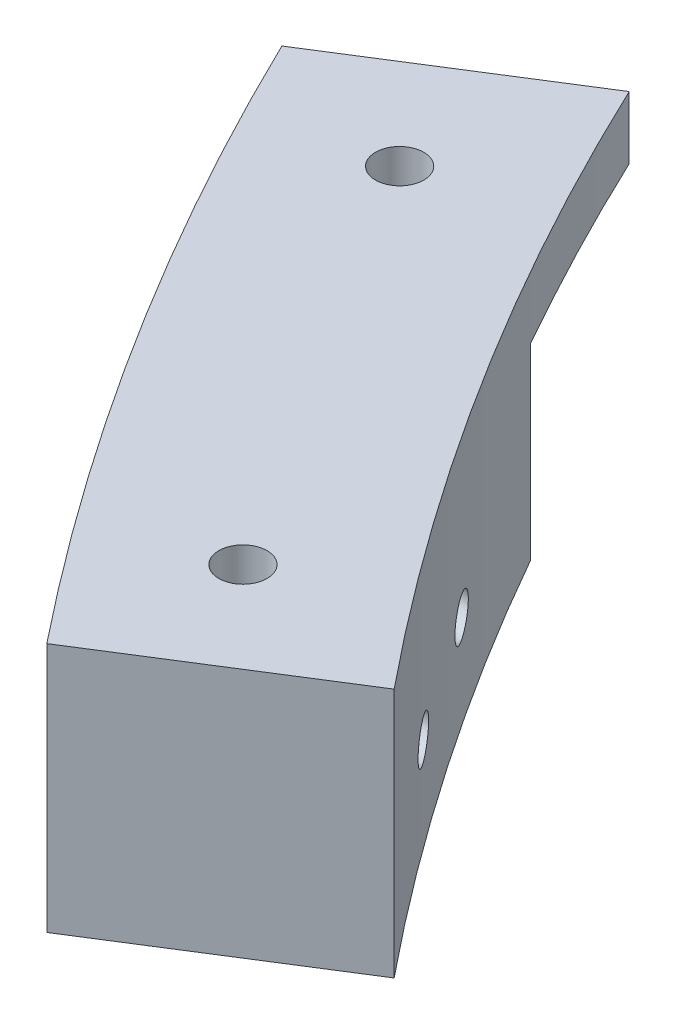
ISO-10303-21;
HEADER;
FILE_DESCRIPTION(('STEP AP214'),'2;1');
FILE_NAME('part.step','',(''),(''),'','','');
FILE_SCHEMA(('AUTOMOTIVE_DESIGN { 1 0 10303 214 1 1 1 1 }'));
ENDSEC;
DATA;
#1=APPLICATION_CONTEXT('core data for automotive mechanical design processes');
#2=APPLICATION_PROTOCOL_DEFINITION('international standard','automotive_design',2000,#1);
#3=PRODUCT_CONTEXT('',#1,'mechanical');
#4=PRODUCT('Part','Part','',(#3));
#5=PRODUCT_RELATED_PRODUCT_CATEGORY('part','',(#4));
#6=PRODUCT_DEFINITION_FORMATION('','',#4);
#7=PRODUCT_DEFINITION_CONTEXT('part definition',#1,'design');
#8=PRODUCT_DEFINITION('design','',#6,#7);
#9=PRODUCT_DEFINITION_SHAPE('','',#8);
#10=(LENGTH_UNIT() NAMED_UNIT(*) SI_UNIT(.MILLI.,.METRE.));
#11=(NAMED_UNIT(*) PLANE_ANGLE_UNIT() SI_UNIT($,.RADIAN.));
#12=(NAMED_UNIT(*) SI_UNIT($,.STERADIAN.) SOLID_ANGLE_UNIT());
#13=UNCERTAINTY_MEASURE_WITH_UNIT(LENGTH_MEASURE(1.E-05),#10,'distance_accuracy_value','');
#14=(GEOMETRIC_REPRESENTATION_CONTEXT(3) GLOBAL_UNCERTAINTY_ASSIGNED_CONTEXT((#13)) GLOBAL_UNIT_ASSIGNED_CONTEXT((#10,
#11,#12)) REPRESENTATION_CONTEXT('',''));
#15=CARTESIAN_POINT('',(0.,0.,0.));
#16=DIRECTION('',(0.,0.,1.));
#17=DIRECTION('',(1.,0.,0.));
#18=AXIS2_PLACEMENT_3D('',#15,#16,#17);
#19=CARTESIAN_POINT('',(0.,-30.1625,0.));
#20=DIRECTION('',(0.,-1.,0.));
#21=DIRECTION('',(0.,0.,-1.));
#22=AXIS2_PLACEMENT_3D('',#19,#20,#21);
#23=CYLINDRICAL_SURFACE('',#22,685.8);
#24=DIRECTION('',(0.,-1.,0.));
#25=VECTOR('',#24,1.);
#26=CARTESIAN_POINT('',(-552.45,-42.8625,406.350387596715));
#27=LINE('',#26,#25);
#28=CARTESIAN_POINT('',(-552.45,-42.8625,406.350387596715));
#29=VERTEX_POINT('',#28);
#30=CARTESIAN_POINT('',(-552.45,-80.9625,406.350387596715));
#31=VERTEX_POINT('',#30);
#32=EDGE_CURVE('E101',#29,#31,#27,.T.);
#33=ORIENTED_EDGE('',*,*,#32,.T.);
#34=CARTESIAN_POINT('',(0.,-80.9625,0.));
#35=DIRECTION('',(0.,-1.,0.));
#36=DIRECTION('',(0.,0.,-1.));
#37=AXIS2_PLACEMENT_3D('',#34,#35,#36);
#38=CIRCLE('',#37,685.8);
#39=CARTESIAN_POINT('',(-536.089202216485,-80.9625,427.703176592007));
#40=VERTEX_POINT('',#39);
#41=EDGE_CURVE('E119',#40,#31,#38,.T.);
#42=ORIENTED_EDGE('',*,*,#41,.F.);
#43=DIRECTION('',(0.,-1.,0.));
#44=VECTOR('',#43,1.);
#45=CARTESIAN_POINT('',(-536.089202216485,-30.1625,427.703176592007));
#46=LINE('',#45,#44);
#47=CARTESIAN_POINT('',(-536.089202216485,-30.1625,427.703176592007));
#48=VERTEX_POINT('',#47);
#49=EDGE_CURVE('E11',#48,#40,#46,.T.);
#50=ORIENTED_EDGE('',*,*,#49,.F.);
#51=CARTESIAN_POINT('',(0.,-30.1625,0.));
#52=DIRECTION('',(0.,-1.,0.));
#53=DIRECTION('',(0.,0.,-1.));
#54=AXIS2_PLACEMENT_3D('',#51,#52,#53);
#55=CIRCLE('',#54,685.8);
#56=CARTESIAN_POINT('',(-617.309061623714,-30.1625,298.74933043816));
#57=VERTEX_POINT('',#56);
#58=EDGE_CURVE('E124',#48,#57,#55,.T.);
#59=ORIENTED_EDGE('',*,*,#58,.T.);
#60=DIRECTION('',(0.,-1.,0.));
#61=VECTOR('',#60,1.);
#62=CARTESIAN_POINT('',(-617.309061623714,-30.1625,298.74933043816));
#63=LINE('',#62,#61);
#64=CARTESIAN_POINT('',(-617.309061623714,-42.8625,298.74933043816));
#65=VERTEX_POINT('',#64);
#66=EDGE_CURVE('E81',#57,#65,#63,.T.);
#67=ORIENTED_EDGE('',*,*,#66,.T.);
#68=CARTESIAN_POINT('',(0.,-42.8625,0.));
#69=DIRECTION('',(0.,-1.,0.));
#70=DIRECTION('',(0.,0.,-1.));
#71=AXIS2_PLACEMENT_3D('',#68,#69,#70);
#72=CIRCLE('',#71,685.8);
#73=EDGE_CURVE('E104',#29,#65,#72,.T.);
#74=ORIENTED_EDGE('',*,*,#73,.F.);
#75=EDGE_LOOP('',(#33,#42,#50,#59,#67,#74));
#76=FACE_BOUND('',#75,.T.);
#77=ADVANCED_FACE('F33',(#76),#23,.T.);
#78=CARTESIAN_POINT('',(-492.8151190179,-30.1625,400.447572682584));
#79=DIRECTION('',(0.532938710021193,0.,0.846153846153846));
#80=DIRECTION('',(0.846153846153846,0.,-0.532938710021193));
#81=AXIS2_PLACEMENT_3D('',#78,#79,#80);
#82=PLANE('',#81);
#83=DIRECTION('',(-0.846153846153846,0.,0.532938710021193));
#84=VECTOR('',#83,1.);
#85=CARTESIAN_POINT('',(-492.8151190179,-80.9625,400.447572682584));
#86=LINE('',#85,#84);
#87=CARTESIAN_POINT('',(-492.8151190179,-80.9625,400.447572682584));
#88=VERTEX_POINT('',#87);
#89=EDGE_CURVE('E127',#88,#40,#86,.T.);
#90=ORIENTED_EDGE('',*,*,#89,.F.);
#91=DIRECTION('',(0.,-1.,0.));
#92=VECTOR('',#91,1.);
#93=CARTESIAN_POINT('',(-492.8151190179,-30.1625,400.447572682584));
#94=LINE('',#93,#92);
#95=CARTESIAN_POINT('',(-492.8151190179,-30.1625,400.447572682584));
#96=VERTEX_POINT('',#95);
#97=EDGE_CURVE('E45',#96,#88,#94,.T.);
#98=ORIENTED_EDGE('',*,*,#97,.F.);
#99=DIRECTION('',(-0.846153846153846,0.,0.532938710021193));
#100=VECTOR('',#99,1.);
#101=CARTESIAN_POINT('',(-492.8151190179,-30.1625,400.447572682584));
#102=LINE('',#101,#100);
#103=EDGE_CURVE('E132',#96,#48,#102,.T.);
#104=ORIENTED_EDGE('',*,*,#103,.T.);
#105=ORIENTED_EDGE('',*,*,#49,.T.);
#106=EDGE_LOOP('',(#90,#98,#104,#105));
#107=FACE_BOUND('',#106,.T.);
#108=ADVANCED_FACE('F180',(#107),#82,.T.);
#109=CARTESIAN_POINT('',(0.,-30.1625,0.));
#110=DIRECTION('',(0.,-1.,0.));
#111=DIRECTION('',(0.,0.,-1.));
#112=AXIS2_PLACEMENT_3D('',#109,#110,#111);
#113=CYLINDRICAL_SURFACE('',#112,635.);
#114=CARTESIAN_POINT('',(-527.694527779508,-61.9125,353.21875));
#115=CARTESIAN_POINT('',(-527.694528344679,-62.0103204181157,353.218749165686));
#116=CARTESIAN_POINT('',(-527.69695293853,-62.1081730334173,353.215126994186));
#117=CARTESIAN_POINT('',(-527.70661718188,-62.3031490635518,353.200688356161));
#118=CARTESIAN_POINT('',(-527.713859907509,-62.4002719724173,353.189867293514));
#119=CARTESIAN_POINT('',(-527.733074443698,-62.5932023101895,353.161156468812));
#120=CARTESIAN_POINT('',(-527.745055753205,-62.6890066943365,353.143252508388));
#121=CARTESIAN_POINT('',(-527.77356722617,-62.8784128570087,353.100640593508));
#122=CARTESIAN_POINT('',(-527.790099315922,-62.9720136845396,353.075929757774));
#123=CARTESIAN_POINT('',(-527.846016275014,-63.2476228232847,352.992333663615));
#124=CARTESIAN_POINT('',(-527.891834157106,-63.4255328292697,352.923817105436));
#125=CARTESIAN_POINT('',(-527.998352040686,-63.7659017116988,352.764438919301));
#126=CARTESIAN_POINT('',(-528.059047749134,-63.9283650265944,352.673583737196));
#127=CARTESIAN_POINT('',(-528.19715996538,-64.245270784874,352.466702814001));
#128=CARTESIAN_POINT('',(-528.275393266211,-64.3985495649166,352.349445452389));
#129=CARTESIAN_POINT('',(-528.443141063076,-64.6832583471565,352.097812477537));
#130=CARTESIAN_POINT('',(-528.532661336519,-64.8146770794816,351.963428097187));
#131=CARTESIAN_POINT('',(-528.735599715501,-65.074198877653,351.658505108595));
#132=CARTESIAN_POINT('',(-528.850544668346,-65.1983593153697,351.485629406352));
#133=CARTESIAN_POINT('',(-529.088867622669,-65.4157483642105,351.126781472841));
#134=CARTESIAN_POINT('',(-529.212250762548,-65.5089579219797,350.940801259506));
#135=CARTESIAN_POINT('',(-529.48540995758,-65.677287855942,350.528559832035));
#136=CARTESIAN_POINT('',(-529.636187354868,-65.7469050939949,350.30070729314));
#137=CARTESIAN_POINT('',(-529.941492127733,-65.8444559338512,349.838665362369));
#138=CARTESIAN_POINT('',(-530.096021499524,-65.8723668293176,349.604472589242));
#139=CARTESIAN_POINT('',(-530.422755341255,-65.8873165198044,349.108576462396));
#140=CARTESIAN_POINT('',(-530.594998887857,-65.8694216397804,348.84673275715));
#141=CARTESIAN_POINT('',(-530.935196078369,-65.7817871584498,348.328743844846));
#142=CARTESIAN_POINT('',(-531.103146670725,-65.7120116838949,348.072602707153));
#143=CARTESIAN_POINT('',(-531.430717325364,-65.5192121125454,347.5722692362));
#144=CARTESIAN_POINT('',(-531.590277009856,-65.3958491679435,347.328164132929));
#145=CARTESIAN_POINT('',(-531.817345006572,-65.1711081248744,346.980303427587));
#146=CARTESIAN_POINT('',(-531.890973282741,-65.0896020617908,346.867423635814));
#147=CARTESIAN_POINT('',(-532.033295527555,-64.9134832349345,346.649086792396));
#148=CARTESIAN_POINT('',(-532.101991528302,-64.8188759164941,346.543626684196));
#149=CARTESIAN_POINT('',(-532.261684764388,-64.5733547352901,346.298322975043));
#150=CARTESIAN_POINT('',(-532.349641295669,-64.4156733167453,346.16308433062));
#151=CARTESIAN_POINT('',(-532.46994233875,-64.1610443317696,345.977984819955));
#152=CARTESIAN_POINT('',(-532.508113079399,-64.0731221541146,345.919230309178));
#153=CARTESIAN_POINT('',(-532.580173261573,-63.8915914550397,345.808275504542));
#154=CARTESIAN_POINT('',(-532.614064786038,-63.7979857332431,345.756072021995));
#155=CARTESIAN_POINT('',(-532.677376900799,-63.6048578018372,345.658524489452));
#156=CARTESIAN_POINT('',(-532.706762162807,-63.5052965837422,345.613234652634));
#157=CARTESIAN_POINT('',(-532.76032190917,-63.3016026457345,345.530666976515));
#158=CARTESIAN_POINT('',(-532.784498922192,-63.197472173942,345.493385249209));
#159=CARTESIAN_POINT('',(-532.827268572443,-62.9854365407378,345.427421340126));
#160=CARTESIAN_POINT('',(-532.845862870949,-62.8775325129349,345.398736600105));
#161=CARTESIAN_POINT('',(-532.877154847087,-62.6588757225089,345.350457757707));
#162=CARTESIAN_POINT('',(-532.889853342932,-62.548123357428,345.330862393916));
#163=CARTESIAN_POINT('',(-532.907970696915,-62.3382175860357,345.302903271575));
#164=CARTESIAN_POINT('',(-532.914079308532,-62.2392638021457,345.293475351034));
#165=CARTESIAN_POINT('',(-532.921465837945,-62.0407126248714,345.282074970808));
#166=CARTESIAN_POINT('',(-532.922742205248,-61.9411150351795,345.280104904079));
#167=CARTESIAN_POINT('',(-532.920438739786,-61.7421758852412,345.28366017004));
#168=CARTESIAN_POINT('',(-532.916862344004,-61.6428341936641,345.28918019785));
#169=CARTESIAN_POINT('',(-532.904918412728,-61.4451185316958,345.30761364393));
#170=CARTESIAN_POINT('',(-532.896549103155,-61.3467449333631,345.320529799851));
#171=CARTESIAN_POINT('',(-532.865601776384,-61.0651395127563,345.368284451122));
#172=CARTESIAN_POINT('',(-532.837005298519,-60.8840286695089,345.41240610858));
#173=CARTESIAN_POINT('',(-532.764475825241,-60.5326603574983,345.524264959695));
#174=CARTESIAN_POINT('',(-532.720540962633,-60.3624042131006,345.592005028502));
#175=CARTESIAN_POINT('',(-532.616513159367,-60.0274598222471,345.752309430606));
#176=CARTESIAN_POINT('',(-532.555692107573,-59.8635350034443,345.845991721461));
#177=CARTESIAN_POINT('',(-532.421466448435,-59.5540593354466,346.052593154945));
#178=CARTESIAN_POINT('',(-532.348056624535,-59.4085161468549,346.165520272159));
#179=CARTESIAN_POINT('',(-532.180828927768,-59.1199112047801,346.422562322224));
#180=CARTESIAN_POINT('',(-532.085600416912,-58.9795811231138,346.568820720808));
#181=CARTESIAN_POINT('',(-531.885035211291,-58.7253975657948,346.87655313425));
#182=CARTESIAN_POINT('',(-531.779692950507,-58.611558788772,347.038035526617));
#183=CARTESIAN_POINT('',(-531.543787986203,-58.3943914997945,347.399273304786));
#184=CARTESIAN_POINT('',(-531.411904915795,-58.29575718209,347.600989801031));
#185=CARTESIAN_POINT('',(-531.141460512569,-58.1345712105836,348.014094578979));
#186=CARTESIAN_POINT('',(-531.002895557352,-58.0720393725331,348.225488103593));
#187=CARTESIAN_POINT('',(-530.701717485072,-57.976311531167,348.684345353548));
#188=CARTESIAN_POINT('',(-530.538526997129,-57.9486730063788,348.932600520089));
#189=CARTESIAN_POINT('',(-530.211334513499,-57.9400236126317,349.429577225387));
#190=CARTESIAN_POINT('',(-530.047331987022,-57.959048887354,349.678298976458));
#191=CARTESIAN_POINT('',(-529.711142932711,-58.0467999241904,350.18738474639));
#192=CARTESIAN_POINT('',(-529.539196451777,-58.1189409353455,350.447330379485));
#193=CARTESIAN_POINT('',(-529.20465337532,-58.31715036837,350.952313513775));
#194=CARTESIAN_POINT('',(-529.042049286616,-58.4431748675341,351.197362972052));
#195=CARTESIAN_POINT('',(-528.765889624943,-58.716359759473,351.612972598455));
#196=CARTESIAN_POINT('',(-528.649275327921,-58.8532584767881,351.788264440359));
#197=CARTESIAN_POINT('',(-528.429914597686,-59.1597183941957,352.11768540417));
#198=CARTESIAN_POINT('',(-528.32715074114,-59.3292378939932,352.271841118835));
#199=CARTESIAN_POINT('',(-528.154350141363,-59.6707040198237,352.530853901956));
#200=CARTESIAN_POINT('',(-528.08171256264,-59.8383438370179,352.639643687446));
#201=CARTESIAN_POINT('',(-527.952781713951,-60.1930920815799,352.832642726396));
#202=CARTESIAN_POINT('',(-527.896484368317,-60.3801956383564,352.916858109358));
#203=CARTESIAN_POINT('',(-527.80799007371,-60.7499082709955,353.049191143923));
#204=CARTESIAN_POINT('',(-527.773931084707,-60.931056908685,353.100098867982));
#205=CARTESIAN_POINT('',(-527.735924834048,-61.2081925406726,353.156897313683));
#206=CARTESIAN_POINT('',(-527.725439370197,-61.3014026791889,353.172565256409));
#207=CARTESIAN_POINT('',(-527.708932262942,-61.4890760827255,353.19722966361));
#208=CARTESIAN_POINT('',(-527.702908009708,-61.5835385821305,353.206230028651));
#209=CARTESIAN_POINT('',(-527.697615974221,-61.7172367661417,353.214136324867));
#210=CARTESIAN_POINT('',(-527.696458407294,-61.7562571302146,353.215865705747));
#211=CARTESIAN_POINT('',(-527.694914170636,-61.8343499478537,353.218172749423));
#212=CARTESIAN_POINT('',(-527.694527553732,-61.8734224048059,353.218750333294));
#213=CARTESIAN_POINT('',(-527.694527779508,-61.9125,353.21875));
#214=B_SPLINE_CURVE_WITH_KNOTS('',3,(#114,#115,#116,#117,#118,#119,#120,#121,#122,#123,#124,
#125,#126,#127,#128,#129,#130,#131,#132,#133,#134,#135,#136,#137,#138,#139,#140,#141,#142,#143,
#144,#145,#146,#147,#148,#149,#150,#151,#152,#153,#154,#155,#156,#157,#158,#159,#160,#161,#162,
#163,#164,#165,#166,#167,#168,#169,#170,#171,#172,#173,#174,#175,#176,#177,#178,#179,#180,#181,
#182,#183,#184,#185,#186,#187,#188,#189,#190,#191,#192,#193,#194,#195,#196,#197,#198,#199,#200,
#201,#202,#203,#204,#205,#206,#207,#208,#209,#210,#211,#212,#213),.UNSPECIFIED.,.T.,.F.,(4,2,2,
2,2,2,2,2,2,2,2,2,2,2,2,2,2,2,2,2,2,2,2,2,2,2,2,2,2,2,2,2,2,2,2,2,2,2,2,2,2,2,2,2,2,2,2,2,2,4),
(0.,0.293419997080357,0.587027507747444,0.881226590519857,1.17555039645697,1.76090071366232,
2.34608232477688,2.96840755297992,3.59105263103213,4.31397495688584,5.03734149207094,
5.87977886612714,6.72267472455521,7.66008018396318,8.59813442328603,9.54220859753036,
10.0140248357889,10.4856455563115,11.1591409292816,11.4960835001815,11.832861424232,
12.1721577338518,12.511288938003,12.8503191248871,13.1893022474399,13.4876830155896,
13.7861595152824,14.0844247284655,14.382800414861,14.9458117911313,15.508891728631,
16.1015776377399,16.694509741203,17.363775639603,18.033411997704,18.811585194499,
19.5901851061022,20.4815023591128,21.3735102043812,22.3285170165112,23.2827468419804,
24.0331889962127,24.7826781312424,25.4179493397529,26.0530619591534,26.623918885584,
26.9089285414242,27.1937713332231,27.3109796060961,27.4281959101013),.UNSPECIFIED.);
#215=CARTESIAN_POINT('',(-527.694527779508,-61.9125,353.21875));
#216=VERTEX_POINT('',#215);
#217=EDGE_CURVE('E36',#216,#216,#214,.T.);
#218=ORIENTED_EDGE('',*,*,#217,.F.);
#219=EDGE_LOOP('',(#218));
#220=FACE_BOUND('',#219,.T.);
#221=CARTESIAN_POINT('',(-509.777247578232,-61.9125,378.61875));
#222=CARTESIAN_POINT('',(-509.77724817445,-62.0081277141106,378.618749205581));
#223=CARTESIAN_POINT('',(-509.779819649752,-62.1037907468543,378.615287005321));
#224=CARTESIAN_POINT('',(-509.790065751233,-62.2943876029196,378.601490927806));
#225=CARTESIAN_POINT('',(-509.797743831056,-62.3893208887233,378.591152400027));
#226=CARTESIAN_POINT('',(-509.818102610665,-62.5778820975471,378.563736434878));
#227=CARTESIAN_POINT('',(-509.830793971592,-62.671506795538,378.546644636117));
#228=CARTESIAN_POINT('',(-509.860972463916,-62.8565673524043,378.50599650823));
#229=CARTESIAN_POINT('',(-509.878461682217,-62.9480022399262,378.482437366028));
#230=CARTESIAN_POINT('',(-509.937535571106,-63.2170599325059,378.402846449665));
#231=CARTESIAN_POINT('',(-509.985860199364,-63.3906337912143,378.337721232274));
#232=CARTESIAN_POINT('',(-510.097947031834,-63.7227248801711,378.186585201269));
#233=CARTESIAN_POINT('',(-510.161704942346,-63.8812462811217,378.100580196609));
#234=CARTESIAN_POINT('',(-510.307038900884,-64.1919522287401,377.904408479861));
#235=CARTESIAN_POINT('',(-510.389562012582,-64.3428765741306,377.792955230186));
#236=CARTESIAN_POINT('',(-510.566254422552,-64.6237819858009,377.554131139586));
#237=CARTESIAN_POINT('',(-510.66042994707,-64.7537517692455,377.426751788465));
#238=CARTESIAN_POINT('',(-510.876391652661,-65.0147642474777,377.134394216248));
#239=CARTESIAN_POINT('',(-511.000036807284,-65.1413949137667,376.966853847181));
#240=CARTESIAN_POINT('',(-511.256369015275,-65.364489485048,376.619133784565));
#241=CARTESIAN_POINT('',(-511.389062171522,-65.4609327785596,376.438945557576));
#242=CARTESIAN_POINT('',(-511.687041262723,-65.6399796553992,376.033837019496));
#243=CARTESIAN_POINT('',(-511.853633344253,-65.716207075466,375.807050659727));
#244=CARTESIAN_POINT('',(-512.191308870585,-65.8267924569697,375.346699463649));
#245=CARTESIAN_POINT('',(-512.362394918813,-65.8611255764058,375.113130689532));
#246=CARTESIAN_POINT('',(-512.729313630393,-65.8900769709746,374.611479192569));
#247=CARTESIAN_POINT('',(-512.925275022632,-65.8784996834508,374.343119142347));
#248=CARTESIAN_POINT('',(-513.313343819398,-65.8008252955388,373.810806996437));
#249=CARTESIAN_POINT('',(-513.505447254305,-65.7346747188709,373.546859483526));
#250=CARTESIAN_POINT('',(-513.787593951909,-65.5930084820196,373.158592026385));
#251=CARTESIAN_POINT('',(-513.881463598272,-65.5380152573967,373.029309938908));
#252=CARTESIAN_POINT('',(-514.065759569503,-65.4134220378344,372.775293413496));
#253=CARTESIAN_POINT('',(-514.156185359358,-65.3438197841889,372.65055968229));
#254=CARTESIAN_POINT('',(-514.332360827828,-65.1900324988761,372.40736448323));
#255=CARTESIAN_POINT('',(-514.41811961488,-65.105877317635,372.288890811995));
#256=CARTESIAN_POINT('',(-514.583949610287,-64.9229038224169,372.05964417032));
#257=CARTESIAN_POINT('',(-514.664023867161,-64.8240934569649,371.948867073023));
#258=CARTESIAN_POINT('',(-514.842953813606,-64.5762457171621,371.701174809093));
#259=CARTESIAN_POINT('',(-514.939104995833,-64.4214758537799,371.567949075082));
#260=CARTESIAN_POINT('',(-515.11533363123,-64.087076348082,371.323599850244));
#261=CARTESIAN_POINT('',(-515.195420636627,-63.9074615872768,371.212463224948));
#262=CARTESIAN_POINT('',(-515.300722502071,-63.6211419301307,371.066259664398));
#263=CARTESIAN_POINT('',(-515.333471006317,-63.5223771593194,371.020776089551));
#264=CARTESIAN_POINT('',(-515.393340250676,-63.319997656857,370.937605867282));
#265=CARTESIAN_POINT('',(-515.420463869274,-63.2163854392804,370.899915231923));
#266=CARTESIAN_POINT('',(-515.468600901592,-63.0051379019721,370.833012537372));
#267=CARTESIAN_POINT('',(-515.489617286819,-62.8975045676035,370.803796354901));
#268=CARTESIAN_POINT('',(-515.525151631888,-62.6791386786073,370.754391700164));
#269=CARTESIAN_POINT('',(-515.539670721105,-62.5684066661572,370.734201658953));
#270=CARTESIAN_POINT('',(-515.560388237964,-62.360281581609,370.705390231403));
#271=CARTESIAN_POINT('',(-515.567454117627,-62.2631395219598,370.695562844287));
#272=CARTESIAN_POINT('',(-515.57641394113,-62.0681622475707,370.683101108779));
#273=CARTESIAN_POINT('',(-515.578308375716,-61.9703270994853,370.680466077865));
#274=CARTESIAN_POINT('',(-515.576892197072,-61.7747967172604,370.682435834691));
#275=CARTESIAN_POINT('',(-515.573583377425,-61.6771014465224,370.687038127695));
#276=CARTESIAN_POINT('',(-515.56182734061,-61.4826496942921,370.703388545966));
#277=CARTESIAN_POINT('',(-515.553380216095,-61.3858931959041,370.715136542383));
#278=CARTESIAN_POINT('',(-515.522031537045,-61.111539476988,370.758730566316));
#279=CARTESIAN_POINT('',(-515.492946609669,-60.935909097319,370.799172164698));
#280=CARTESIAN_POINT('',(-515.418895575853,-60.5949231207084,370.902097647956));
#281=CARTESIAN_POINT('',(-515.373927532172,-60.4295687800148,370.964584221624));
#282=CARTESIAN_POINT('',(-515.267060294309,-60.1028869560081,371.113008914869));
#283=CARTESIAN_POINT('',(-515.204323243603,-59.9423634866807,371.200106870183));
#284=CARTESIAN_POINT('',(-515.065841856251,-59.6386719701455,371.392235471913));
#285=CARTESIAN_POINT('',(-514.990091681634,-59.4955117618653,371.497274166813));
#286=CARTESIAN_POINT('',(-514.816014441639,-59.2080161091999,371.738478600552));
#287=CARTESIAN_POINT('',(-514.716005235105,-59.0666407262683,371.876950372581));
#288=CARTESIAN_POINT('',(-514.50529488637,-58.8091753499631,372.168421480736));
#289=CARTESIAN_POINT('',(-514.394587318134,-58.6931006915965,372.32142954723));
#290=CARTESIAN_POINT('',(-514.143419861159,-58.4666149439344,372.668214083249));
#291=CARTESIAN_POINT('',(-514.001299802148,-58.3614549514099,372.86421828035));
#292=CARTESIAN_POINT('',(-513.709546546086,-58.1863977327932,373.266076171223));
#293=CARTESIAN_POINT('',(-513.55990895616,-58.116521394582,373.471935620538));
#294=CARTESIAN_POINT('',(-513.22948129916,-58.0021716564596,373.925916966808));
#295=CARTESIAN_POINT('',(-513.047841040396,-57.9643277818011,374.17510390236));
#296=CARTESIAN_POINT('',(-512.682806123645,-57.9359263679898,374.675107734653));
#297=CARTESIAN_POINT('',(-512.499409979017,-57.9454132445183,374.925925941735));
#298=CARTESIAN_POINT('',(-512.117681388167,-58.0149249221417,375.447192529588));
#299=CARTESIAN_POINT('',(-511.919606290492,-58.0797164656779,375.717212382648));
#300=CARTESIAN_POINT('',(-511.532810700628,-58.2670700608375,376.243657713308));
#301=CARTESIAN_POINT('',(-511.344082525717,-58.3895837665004,376.500094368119));
#302=CARTESIAN_POINT('',(-511.026130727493,-58.6576218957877,376.931489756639));
#303=CARTESIAN_POINT('',(-510.893353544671,-58.7909523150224,377.111424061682));
#304=CARTESIAN_POINT('',(-510.642267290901,-59.0920658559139,377.451346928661));
#305=CARTESIAN_POINT('',(-510.52393609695,-59.2597952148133,377.61136599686));
#306=CARTESIAN_POINT('',(-510.326466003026,-59.5957789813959,377.878182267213));
#307=CARTESIAN_POINT('',(-510.244101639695,-59.7585941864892,377.989380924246));
#308=CARTESIAN_POINT('',(-510.133284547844,-60.0181686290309,378.13891080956));
#309=CARTESIAN_POINT('',(-510.098446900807,-60.107320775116,378.185903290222));
#310=CARTESIAN_POINT('',(-510.033484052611,-60.290331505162,378.273509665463));
#311=CARTESIAN_POINT('',(-510.003356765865,-60.3841879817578,378.314126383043));
#312=CARTESIAN_POINT('',(-509.948010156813,-60.5769577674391,378.388727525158));
#313=CARTESIAN_POINT('',(-509.922837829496,-60.6759092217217,378.422648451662));
#314=CARTESIAN_POINT('',(-509.878186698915,-60.8773216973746,378.482808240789));
#315=CARTESIAN_POINT('',(-509.858704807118,-60.9797807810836,378.509051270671));
#316=CARTESIAN_POINT('',(-509.825828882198,-61.1871129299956,378.55333173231));
#317=CARTESIAN_POINT('',(-509.812418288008,-61.2919785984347,378.571391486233));
#318=CARTESIAN_POINT('',(-509.79188478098,-61.5033685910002,378.59904187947));
#319=CARTESIAN_POINT('',(-509.784756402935,-61.609891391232,378.60863988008));
#320=CARTESIAN_POINT('',(-509.779641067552,-61.7492903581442,378.615527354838));
#321=CARTESIAN_POINT('',(-509.778743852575,-61.7819128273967,378.61673538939));
#322=CARTESIAN_POINT('',(-509.777547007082,-61.8471888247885,378.618346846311));
#323=CARTESIAN_POINT('',(-509.777247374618,-61.8798423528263,378.6187502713));
#324=CARTESIAN_POINT('',(-509.777247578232,-61.9125,378.61875));
#325=B_SPLINE_CURVE_WITH_KNOTS('',3,(#221,#222,#223,#224,#225,#226,#227,#228,#229,#230,#231,
#232,#233,#234,#235,#236,#237,#238,#239,#240,#241,#242,#243,#244,#245,#246,#247,#248,#249,#250,
#251,#252,#253,#254,#255,#256,#257,#258,#259,#260,#261,#262,#263,#264,#265,#266,#267,#268,#269,
#270,#271,#272,#273,#274,#275,#276,#277,#278,#279,#280,#281,#282,#283,#284,#285,#286,#287,#288,
#289,#290,#291,#292,#293,#294,#295,#296,#297,#298,#299,#300,#301,#302,#303,#304,#305,#306,#307,
#308,#309,#310,#311,#312,#313,#314,#315,#316,#317,#318,#319,#320,#321,#322,#323,#324),
.UNSPECIFIED.,.T.,.F.,(4,2,2,2,2,2,2,2,2,2,2,2,2,2,2,2,2,2,2,2,2,2,2,2,2,2,2,2,2,2,2,2,2,2,2,2,
2,2,2,2,2,2,2,2,2,2,2,2,2,2,2,4),(0.,0.286847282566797,0.573888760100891,0.861543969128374,
1.14932449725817,1.72127675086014,2.29307006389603,2.90568180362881,3.51862230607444,
4.24705288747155,4.97597975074,5.84719128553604,6.71891917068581,7.71202688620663,
8.70610890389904,9.21241061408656,9.71879066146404,10.2241441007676,10.7292244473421,
11.4036508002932,12.0776749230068,12.4179260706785,12.758002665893,13.0979135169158,
13.4377652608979,13.7310549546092,14.0243168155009,14.3174776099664,14.6106331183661,
15.1556580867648,15.7007495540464,16.277788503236,16.8550870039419,17.5178006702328,
18.1809149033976,18.9698171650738,19.7591859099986,20.6873906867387,21.6164666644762,
22.6347822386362,23.6522464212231,24.4303457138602,25.2072380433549,25.8454390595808,
26.1649934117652,26.4844058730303,26.8067154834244,27.1288498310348,27.4501000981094,
27.7710706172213,27.8690316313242,27.9669923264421),.UNSPECIFIED.);
#326=CARTESIAN_POINT('',(-509.777247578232,-61.9125,378.61875));
#327=VERTEX_POINT('',#326);
#328=EDGE_CURVE('E142',#327,#327,#325,.T.);
#329=ORIENTED_EDGE('',*,*,#328,.F.);
#330=EDGE_LOOP('',(#329));
#331=FACE_BOUND('',#330,.T.);
#332=DIRECTION('',(0.,-1.,0.));
#333=VECTOR('',#332,1.);
#334=CARTESIAN_POINT('',(-552.45,-42.8625,313.087843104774));
#335=LINE('',#334,#333);
#336=CARTESIAN_POINT('',(-552.45,-42.8625,313.087843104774));
#337=VERTEX_POINT('',#336);
#338=CARTESIAN_POINT('',(-552.45,-80.9625,313.087843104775));
#339=VERTEX_POINT('',#338);
#340=EDGE_CURVE('E53',#337,#339,#335,.T.);
#341=ORIENTED_EDGE('',*,*,#340,.F.);
#342=CARTESIAN_POINT('',(0.,-42.8625,0.));
#343=DIRECTION('',(0.,1.,0.));
#344=DIRECTION('',(0.,0.,1.));
#345=AXIS2_PLACEMENT_3D('',#342,#343,#344);
#346=CIRCLE('',#345,635.);
#347=CARTESIAN_POINT('',(-574.03497842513,-42.8625,271.493726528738));
#348=VERTEX_POINT('',#347);
#349=EDGE_CURVE('E105',#348,#337,#346,.T.);
#350=ORIENTED_EDGE('',*,*,#349,.F.);
#351=DIRECTION('',(0.,-1.,0.));
#352=VECTOR('',#351,1.);
#353=CARTESIAN_POINT('',(-574.03497842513,-30.1625,271.493726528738));
#354=LINE('',#353,#352);
#355=CARTESIAN_POINT('',(-574.03497842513,-30.1625,271.493726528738));
#356=VERTEX_POINT('',#355);
#357=EDGE_CURVE('E140',#356,#348,#354,.T.);
#358=ORIENTED_EDGE('',*,*,#357,.F.);
#359=CARTESIAN_POINT('',(0.,-30.1625,0.));
#360=DIRECTION('',(0.,1.,0.));
#361=DIRECTION('',(0.,0.,1.));
#362=AXIS2_PLACEMENT_3D('',#359,#360,#361);
#363=CIRCLE('',#362,635.);
#364=EDGE_CURVE('E129',#356,#96,#363,.T.);
#365=ORIENTED_EDGE('',*,*,#364,.T.);
#366=ORIENTED_EDGE('',*,*,#97,.T.);
#367=CARTESIAN_POINT('',(0.,-80.9625,0.));
#368=DIRECTION('',(0.,1.,0.));
#369=DIRECTION('',(0.,0.,1.));
#370=AXIS2_PLACEMENT_3D('',#367,#368,#369);
#371=CIRCLE('',#370,635.);
#372=EDGE_CURVE('E117',#339,#88,#371,.T.);
#373=ORIENTED_EDGE('',*,*,#372,.F.);
#374=EDGE_LOOP('',(#341,#350,#358,#365,#366,#373));
#375=FACE_BOUND('',#374,.T.);
#376=ADVANCED_FACE('F115',(#220,#331,#375),#113,.F.);
#377=CARTESIAN_POINT('',(-617.309061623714,-30.1625,298.74933043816));
#378=DIRECTION('',(-0.532938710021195,0.,-0.846153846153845));
#379=DIRECTION('',(-0.846153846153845,0.,0.532938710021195));
#380=AXIS2_PLACEMENT_3D('',#377,#378,#379);
#381=PLANE('',#380);
#382=DIRECTION('',(0.846153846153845,0.,-0.532938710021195));
#383=VECTOR('',#382,1.);
#384=CARTESIAN_POINT('',(-617.309061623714,-42.8625,298.74933043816));
#385=LINE('',#384,#383);
#386=EDGE_CURVE('E109',#65,#348,#385,.T.);
#387=ORIENTED_EDGE('',*,*,#386,.F.);
#388=ORIENTED_EDGE('',*,*,#66,.F.);
#389=DIRECTION('',(0.846153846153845,0.,-0.532938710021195));
#390=VECTOR('',#389,1.);
#391=CARTESIAN_POINT('',(-617.309061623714,-30.1625,298.74933043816));
#392=LINE('',#391,#390);
#393=EDGE_CURVE('E126',#57,#356,#392,.T.);
#394=ORIENTED_EDGE('',*,*,#393,.T.);
#395=ORIENTED_EDGE('',*,*,#357,.T.);
#396=EDGE_LOOP('',(#387,#388,#394,#395));
#397=FACE_BOUND('',#396,.T.);
#398=ADVANCED_FACE('F176',(#397),#381,.T.);
#399=CARTESIAN_POINT('',(0.,-30.1625,0.));
#400=DIRECTION('',(0.,-1.,0.));
#401=DIRECTION('',(0.,0.,-1.));
#402=AXIS2_PLACEMENT_3D('',#399,#400,#401);
#403=PLANE('',#402);
#404=CARTESIAN_POINT('',(-584.217579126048,-30.1625,307.925283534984));
#405=DIRECTION('',(0.,1.,0.));
#406=DIRECTION('',(0.,0.,1.));
#407=AXIS2_PLACEMENT_3D('',#404,#405,#406);
#408=CIRCLE('',#407,4.90219999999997);
#409=CARTESIAN_POINT('',(-584.217579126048,-30.1625,312.827483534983));
#410=VERTEX_POINT('',#409);
#411=EDGE_CURVE('E147',#410,#410,#408,.T.);
#412=ORIENTED_EDGE('',*,*,#411,.F.);
#413=EDGE_LOOP('',(#412));
#414=FACE_BOUND('',#413,.T.);
#415=CARTESIAN_POINT('',(-530.071006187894,-30.1625,393.894514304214));
#416=DIRECTION('',(0.,-1.,0.));
#417=DIRECTION('',(0.,0.,-1.));
#418=AXIS2_PLACEMENT_3D('',#415,#416,#417);
#419=CIRCLE('',#418,4.90219999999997);
#420=CARTESIAN_POINT('',(-530.071006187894,-30.1625,388.992314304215));
#421=VERTEX_POINT('',#420);
#422=EDGE_CURVE('E192',#421,#421,#419,.T.);
#423=ORIENTED_EDGE('',*,*,#422,.T.);
#424=EDGE_LOOP('',(#423));
#425=FACE_BOUND('',#424,.T.);
#426=ORIENTED_EDGE('',*,*,#58,.F.);
#427=ORIENTED_EDGE('',*,*,#103,.F.);
#428=ORIENTED_EDGE('',*,*,#364,.F.);
#429=ORIENTED_EDGE('',*,*,#393,.F.);
#430=EDGE_LOOP('',(#426,#427,#428,#429));
#431=FACE_BOUND('',#430,.T.);
#432=ADVANCED_FACE('F173',(#414,#425,#431),#403,.F.);
#433=CARTESIAN_POINT('',(0.,-80.9625,0.));
#434=DIRECTION('',(0.,-1.,0.));
#435=DIRECTION('',(0.,0.,-1.));
#436=AXIS2_PLACEMENT_3D('',#433,#434,#435);
#437=PLANE('',#436);
#438=CARTESIAN_POINT('',(-530.071006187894,-80.9625,393.894514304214));
#439=DIRECTION('',(0.,-1.,0.));
#440=DIRECTION('',(0.,0.,-1.));
#441=AXIS2_PLACEMENT_3D('',#438,#439,#440);
#442=CIRCLE('',#441,4.90219999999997);
#443=CARTESIAN_POINT('',(-530.071006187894,-80.9625,388.992314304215));
#444=VERTEX_POINT('',#443);
#445=EDGE_CURVE('E194',#444,#444,#442,.T.);
#446=ORIENTED_EDGE('',*,*,#445,.F.);
#447=EDGE_LOOP('',(#446));
#448=FACE_BOUND('',#447,.T.);
#449=DIRECTION('',(0.,0.,1.));
#450=VECTOR('',#449,1.);
#451=CARTESIAN_POINT('',(-552.45,-80.9625,313.087843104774));
#452=LINE('',#451,#450);
#453=EDGE_CURVE('E112',#339,#31,#452,.T.);
#454=ORIENTED_EDGE('',*,*,#453,.F.);
#455=ORIENTED_EDGE('',*,*,#372,.T.);
#456=ORIENTED_EDGE('',*,*,#89,.T.);
#457=ORIENTED_EDGE('',*,*,#41,.T.);
#458=EDGE_LOOP('',(#454,#455,#456,#457));
#459=FACE_BOUND('',#458,.T.);
#460=ADVANCED_FACE('F171',(#448,#459),#437,.T.);
#461=CARTESIAN_POINT('',(-552.45,-42.8625,313.087843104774));
#462=DIRECTION('',(1.,0.,0.));
#463=DIRECTION('',(0.,0.,-1.));
#464=AXIS2_PLACEMENT_3D('',#461,#462,#463);
#465=PLANE('',#464);
#466=CARTESIAN_POINT('',(-552.45,-61.9125,349.25));
#467=DIRECTION('',(-1.,0.,0.));
#468=DIRECTION('',(0.,0.,1.));
#469=AXIS2_PLACEMENT_3D('',#466,#467,#468);
#470=CIRCLE('',#469,3.96874999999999);
#471=CARTESIAN_POINT('',(-552.45,-61.9125,353.21875));
#472=VERTEX_POINT('',#471);
#473=EDGE_CURVE('E208',#472,#472,#470,.T.);
#474=ORIENTED_EDGE('',*,*,#473,.F.);
#475=EDGE_LOOP('',(#474));
#476=FACE_BOUND('',#475,.T.);
#477=CARTESIAN_POINT('',(-552.45,-61.9125,374.65));
#478=DIRECTION('',(-1.,0.,0.));
#479=DIRECTION('',(0.,0.,1.));
#480=AXIS2_PLACEMENT_3D('',#477,#478,#479);
#481=CIRCLE('',#480,3.96874999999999);
#482=CARTESIAN_POINT('',(-552.45,-61.9125,378.61875));
#483=VERTEX_POINT('',#482);
#484=EDGE_CURVE('E148',#483,#483,#481,.T.);
#485=ORIENTED_EDGE('',*,*,#484,.F.);
#486=EDGE_LOOP('',(#485));
#487=FACE_BOUND('',#486,.T.);
#488=ORIENTED_EDGE('',*,*,#453,.T.);
#489=ORIENTED_EDGE('',*,*,#32,.F.);
#490=DIRECTION('',(0.,0.,1.));
#491=VECTOR('',#490,1.);
#492=CARTESIAN_POINT('',(-552.45,-42.8625,313.087843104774));
#493=LINE('',#492,#491);
#494=EDGE_CURVE('E97',#337,#29,#493,.T.);
#495=ORIENTED_EDGE('',*,*,#494,.F.);
#496=ORIENTED_EDGE('',*,*,#340,.T.);
#497=EDGE_LOOP('',(#488,#489,#495,#496));
#498=FACE_BOUND('',#497,.T.);
#499=ADVANCED_FACE('F99',(#476,#487,#498),#465,.F.);
#500=CARTESIAN_POINT('',(0.,-42.8625,0.));
#501=DIRECTION('',(0.,1.,0.));
#502=DIRECTION('',(0.,0.,1.));
#503=AXIS2_PLACEMENT_3D('',#500,#501,#502);
#504=PLANE('',#503);
#505=CARTESIAN_POINT('',(-584.217579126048,-42.8625,307.925283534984));
#506=DIRECTION('',(0.,1.,0.));
#507=DIRECTION('',(0.,0.,1.));
#508=AXIS2_PLACEMENT_3D('',#505,#506,#507);
#509=CIRCLE('',#508,4.90219999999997);
#510=CARTESIAN_POINT('',(-584.217579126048,-42.8625,312.827483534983));
#511=VERTEX_POINT('',#510);
#512=EDGE_CURVE('E199',#511,#511,#509,.T.);
#513=ORIENTED_EDGE('',*,*,#512,.T.);
#514=EDGE_LOOP('',(#513));
#515=FACE_BOUND('',#514,.T.);
#516=ORIENTED_EDGE('',*,*,#349,.T.);
#517=ORIENTED_EDGE('',*,*,#494,.T.);
#518=ORIENTED_EDGE('',*,*,#73,.T.);
#519=ORIENTED_EDGE('',*,*,#386,.T.);
#520=EDGE_LOOP('',(#516,#517,#518,#519));
#521=FACE_BOUND('',#520,.T.);
#522=ADVANCED_FACE('F108',(#515,#521),#504,.F.);
#523=CARTESIAN_POINT('',(-530.071006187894,-80.9625,393.894514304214));
#524=DIRECTION('',(0.,-1.,0.));
#525=DIRECTION('',(0.,0.,-1.));
#526=AXIS2_PLACEMENT_3D('',#523,#524,#525);
#527=CYLINDRICAL_SURFACE('',#526,4.90219999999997);
#528=ORIENTED_EDGE('',*,*,#422,.F.);
#529=EDGE_LOOP('',(#528));
#530=FACE_BOUND('',#529,.T.);
#531=ORIENTED_EDGE('',*,*,#445,.T.);
#532=EDGE_LOOP('',(#531));
#533=FACE_BOUND('',#532,.T.);
#534=ADVANCED_FACE('F161',(#530,#533),#527,.F.);
#535=CARTESIAN_POINT('',(-584.217579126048,-30.1625,307.925283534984));
#536=DIRECTION('',(0.,1.,0.));
#537=DIRECTION('',(0.,0.,1.));
#538=AXIS2_PLACEMENT_3D('',#535,#536,#537);
#539=CYLINDRICAL_SURFACE('',#538,4.90219999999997);
#540=ORIENTED_EDGE('',*,*,#411,.T.);
#541=EDGE_LOOP('',(#540));
#542=FACE_BOUND('',#541,.T.);
#543=ORIENTED_EDGE('',*,*,#512,.F.);
#544=EDGE_LOOP('',(#543));
#545=FACE_BOUND('',#544,.T.);
#546=ADVANCED_FACE('F156',(#542,#545),#539,.F.);
#547=CARTESIAN_POINT('',(-552.45,-61.9125,374.65));
#548=DIRECTION('',(-1.,0.,0.));
#549=DIRECTION('',(0.,0.,1.));
#550=AXIS2_PLACEMENT_3D('',#547,#548,#549);
#551=CYLINDRICAL_SURFACE('',#550,3.96874999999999);
#552=ORIENTED_EDGE('',*,*,#328,.T.);
#553=EDGE_LOOP('',(#552));
#554=FACE_BOUND('',#553,.T.);
#555=ORIENTED_EDGE('',*,*,#484,.T.);
#556=EDGE_LOOP('',(#555));
#557=FACE_BOUND('',#556,.T.);
#558=ADVANCED_FACE('F151',(#554,#557),#551,.F.);
#559=CARTESIAN_POINT('',(-552.45,-61.9125,349.25));
#560=DIRECTION('',(-1.,0.,0.));
#561=DIRECTION('',(0.,0.,1.));
#562=AXIS2_PLACEMENT_3D('',#559,#560,#561);
#563=CYLINDRICAL_SURFACE('',#562,3.96874999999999);
#564=ORIENTED_EDGE('',*,*,#217,.T.);
#565=EDGE_LOOP('',(#564));
#566=FACE_BOUND('',#565,.T.);
#567=ORIENTED_EDGE('',*,*,#473,.T.);
#568=EDGE_LOOP('',(#567));
#569=FACE_BOUND('',#568,.T.);
#570=ADVANCED_FACE('F155',(#566,#569),#563,.F.);
#571=CLOSED_SHELL('',(#77,#108,#376,#398,#432,#460,#499,#522,#534,#546,#558,#570));
#572=MANIFOLD_SOLID_BREP('B2',#571);
#573=ADVANCED_BREP_SHAPE_REPRESENTATION('',(#18,#572),#14);
#574=SHAPE_DEFINITION_REPRESENTATION(#9,#573);
ENDSEC;
END-ISO-10303-21;
